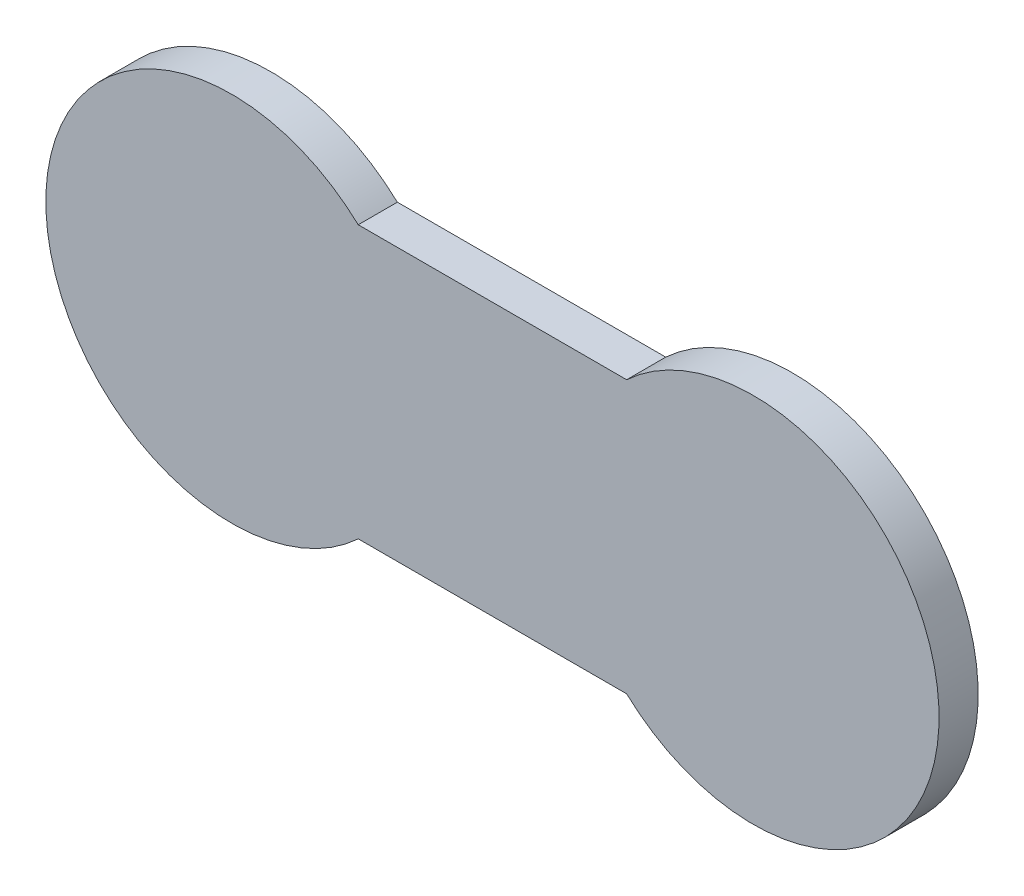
from build123d import *

# Parameters (mm, degrees)
BOSS_EXTRU_2_DEPTH = 6


with BuildPart() as part:
    # Esquisse2 → Boss.-Extru.2 (new body)
    with BuildSketch(Plane.XY):
        with BuildLine():
            Line((49.418600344, 9), (90.581399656, 9))
            ThreePointArc((90.581399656, 9), (138.5, 29.860679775), (90.581399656, 50.72135955))
            Line((90.581399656, 50.72135955), (49.418600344, 50.72135955))
            ThreePointArc((49.418600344, 50.72135955), (1.5, 29.860679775), (49.418600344, 9))
        make_face()
    extrude(amount=BOSS_EXTRU_2_DEPTH)


solid = part.part
